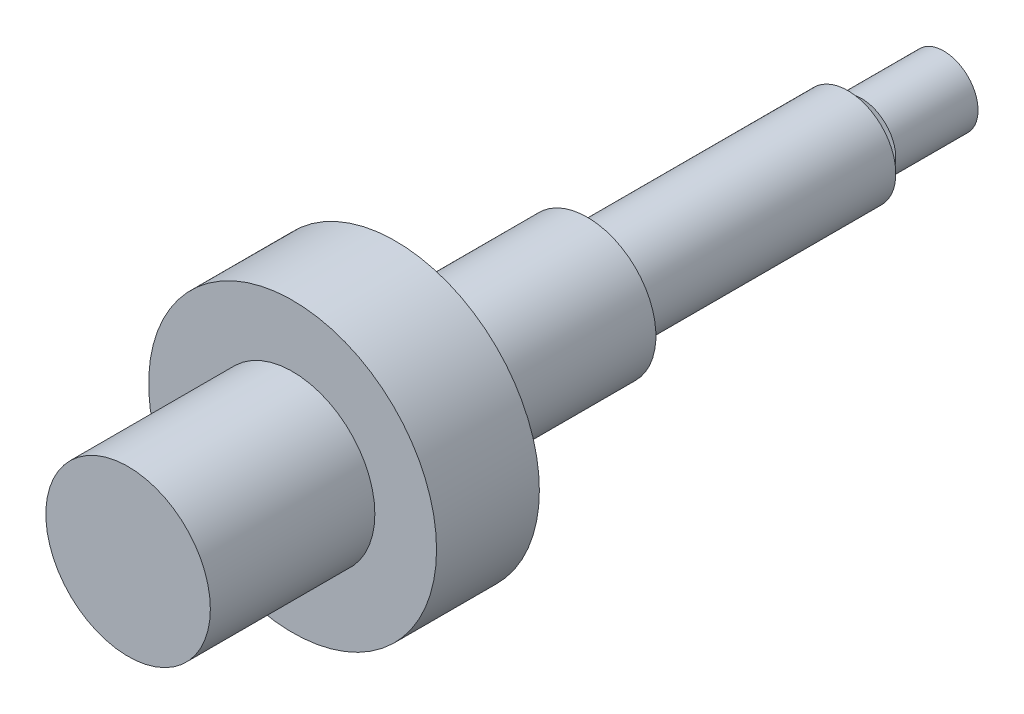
ISO-10303-21;
HEADER;
FILE_DESCRIPTION(('STEP AP214'),'2;1');
FILE_NAME('part.step','',(''),(''),'','','');
FILE_SCHEMA(('AUTOMOTIVE_DESIGN { 1 0 10303 214 1 1 1 1 }'));
ENDSEC;
DATA;
#1=APPLICATION_CONTEXT('core data for automotive mechanical design processes');
#2=APPLICATION_PROTOCOL_DEFINITION('international standard','automotive_design',2000,#1);
#3=PRODUCT_CONTEXT('',#1,'mechanical');
#4=PRODUCT('Part','Part','',(#3));
#5=PRODUCT_RELATED_PRODUCT_CATEGORY('part','',(#4));
#6=PRODUCT_DEFINITION_FORMATION('','',#4);
#7=PRODUCT_DEFINITION_CONTEXT('part definition',#1,'design');
#8=PRODUCT_DEFINITION('design','',#6,#7);
#9=PRODUCT_DEFINITION_SHAPE('','',#8);
#10=(LENGTH_UNIT() NAMED_UNIT(*) SI_UNIT(.MILLI.,.METRE.));
#11=(NAMED_UNIT(*) PLANE_ANGLE_UNIT() SI_UNIT($,.RADIAN.));
#12=(NAMED_UNIT(*) SI_UNIT($,.STERADIAN.) SOLID_ANGLE_UNIT());
#13=UNCERTAINTY_MEASURE_WITH_UNIT(LENGTH_MEASURE(1.E-05),#10,'distance_accuracy_value','');
#14=(GEOMETRIC_REPRESENTATION_CONTEXT(3) GLOBAL_UNCERTAINTY_ASSIGNED_CONTEXT((#13)) GLOBAL_UNIT_ASSIGNED_CONTEXT((#10,
#11,#12)) REPRESENTATION_CONTEXT('',''));
#15=CARTESIAN_POINT('',(0.,0.,0.));
#16=DIRECTION('',(0.,0.,1.));
#17=DIRECTION('',(1.,0.,0.));
#18=AXIS2_PLACEMENT_3D('',#15,#16,#17);
#19=CARTESIAN_POINT('',(0.,0.,-33.));
#20=DIRECTION('',(0.,0.,-1.));
#21=DIRECTION('',(-1.,0.,0.));
#22=AXIS2_PLACEMENT_3D('',#19,#20,#21);
#23=PLANE('',#22);
#24=CARTESIAN_POINT('',(0.,0.,-33.));
#25=DIRECTION('',(0.,0.,-1.));
#26=DIRECTION('',(-1.,0.,0.));
#27=AXIS2_PLACEMENT_3D('',#24,#25,#26);
#28=CIRCLE('',#27,3.5);
#29=CARTESIAN_POINT('',(-3.5,0.,-33.));
#30=VERTEX_POINT('',#29);
#31=EDGE_CURVE('E65',#30,#30,#28,.T.);
#32=ORIENTED_EDGE('',*,*,#31,.T.);
#33=EDGE_LOOP('',(#32));
#34=FACE_BOUND('',#33,.T.);
#35=CARTESIAN_POINT('',(0.,0.,-33.));
#36=DIRECTION('',(0.,0.,-1.));
#37=DIRECTION('',(-1.,0.,0.));
#38=AXIS2_PLACEMENT_3D('',#35,#36,#37);
#39=CIRCLE('',#38,1.5);
#40=CARTESIAN_POINT('',(-1.5,0.,-33.));
#41=VERTEX_POINT('',#40);
#42=EDGE_CURVE('E74',#41,#41,#39,.T.);
#43=ORIENTED_EDGE('',*,*,#42,.F.);
#44=EDGE_LOOP('',(#43));
#45=FACE_BOUND('',#44,.T.);
#46=ADVANCED_FACE('F29',(#34,#45),#23,.T.);
#47=CARTESIAN_POINT('',(0.,0.,-14.));
#48=DIRECTION('',(0.,0.,-1.));
#49=DIRECTION('',(-1.,0.,0.));
#50=AXIS2_PLACEMENT_3D('',#47,#48,#49);
#51=PLANE('',#50);
#52=CARTESIAN_POINT('',(0.,0.,-14.));
#53=DIRECTION('',(0.,0.,-1.));
#54=DIRECTION('',(-1.,0.,0.));
#55=AXIS2_PLACEMENT_3D('',#52,#53,#54);
#56=CIRCLE('',#55,5.);
#57=CARTESIAN_POINT('',(-5.,0.,-14.));
#58=VERTEX_POINT('',#57);
#59=EDGE_CURVE('E55',#58,#58,#56,.T.);
#60=ORIENTED_EDGE('',*,*,#59,.T.);
#61=EDGE_LOOP('',(#60));
#62=FACE_BOUND('',#61,.T.);
#63=CARTESIAN_POINT('',(0.,0.,-14.));
#64=DIRECTION('',(0.,0.,-1.));
#65=DIRECTION('',(-1.,0.,0.));
#66=AXIS2_PLACEMENT_3D('',#63,#64,#65);
#67=CIRCLE('',#66,2.5);
#68=CARTESIAN_POINT('',(-2.5,0.,-14.));
#69=VERTEX_POINT('',#68);
#70=EDGE_CURVE('E62',#69,#69,#67,.T.);
#71=ORIENTED_EDGE('',*,*,#70,.F.);
#72=EDGE_LOOP('',(#71));
#73=FACE_BOUND('',#72,.T.);
#74=ADVANCED_FACE('F108',(#62,#73),#51,.T.);
#75=CARTESIAN_POINT('',(0.,0.,0.));
#76=DIRECTION('',(0.,0.,1.));
#77=DIRECTION('',(1.,0.,0.));
#78=AXIS2_PLACEMENT_3D('',#75,#76,#77);
#79=PLANE('',#78);
#80=CARTESIAN_POINT('',(0.,0.,0.));
#81=DIRECTION('',(0.,0.,1.));
#82=DIRECTION('',(1.,0.,0.));
#83=AXIS2_PLACEMENT_3D('',#80,#81,#82);
#84=CIRCLE('',#83,10.5);
#85=CARTESIAN_POINT('',(10.5,0.,0.));
#86=VERTEX_POINT('',#85);
#87=EDGE_CURVE('E40',#86,#86,#84,.T.);
#88=ORIENTED_EDGE('',*,*,#87,.F.);
#89=EDGE_LOOP('',(#88));
#90=FACE_BOUND('',#89,.T.);
#91=CARTESIAN_POINT('',(0.,0.,0.));
#92=DIRECTION('',(0.,0.,1.));
#93=DIRECTION('',(1.,0.,0.));
#94=AXIS2_PLACEMENT_3D('',#91,#92,#93);
#95=CIRCLE('',#94,4.5);
#96=CARTESIAN_POINT('',(4.5,0.,0.));
#97=VERTEX_POINT('',#96);
#98=EDGE_CURVE('E10',#97,#97,#95,.F.);
#99=ORIENTED_EDGE('',*,*,#98,.F.);
#100=EDGE_LOOP('',(#99));
#101=FACE_BOUND('',#100,.T.);
#102=ADVANCED_FACE('F114',(#90,#101),#79,.F.);
#103=CARTESIAN_POINT('',(-7.,33.,7.5));
#104=DIRECTION('',(0.,0.,1.));
#105=DIRECTION('',(1.,0.,0.));
#106=AXIS2_PLACEMENT_3D('',#103,#104,#105);
#107=PLANE('',#106);
#108=CARTESIAN_POINT('',(0.,0.,7.5));
#109=DIRECTION('',(0.,0.,1.));
#110=DIRECTION('',(1.,0.,0.));
#111=AXIS2_PLACEMENT_3D('',#108,#109,#110);
#112=CIRCLE('',#111,10.5);
#113=CARTESIAN_POINT('',(10.5,0.,7.5));
#114=VERTEX_POINT('',#113);
#115=EDGE_CURVE('E36',#114,#114,#112,.T.);
#116=ORIENTED_EDGE('',*,*,#115,.T.);
#117=EDGE_LOOP('',(#116));
#118=FACE_BOUND('',#117,.T.);
#119=CARTESIAN_POINT('',(0.,0.,7.5));
#120=DIRECTION('',(0.,0.,1.));
#121=DIRECTION('',(1.,0.,0.));
#122=AXIS2_PLACEMENT_3D('',#119,#120,#121);
#123=CIRCLE('',#122,6.);
#124=CARTESIAN_POINT('',(6.,0.,7.5));
#125=VERTEX_POINT('',#124);
#126=EDGE_CURVE('E47',#125,#125,#123,.T.);
#127=ORIENTED_EDGE('',*,*,#126,.F.);
#128=EDGE_LOOP('',(#127));
#129=FACE_BOUND('',#128,.T.);
#130=ADVANCED_FACE('F31',(#118,#129),#107,.T.);
#131=CARTESIAN_POINT('',(0.,0.,37.198484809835));
#132=DIRECTION('',(0.,0.,-1.));
#133=DIRECTION('',(-1.,0.,0.));
#134=AXIS2_PLACEMENT_3D('',#131,#132,#133);
#135=CYLINDRICAL_SURFACE('',#134,10.5);
#136=ORIENTED_EDGE('',*,*,#87,.T.);
#137=EDGE_LOOP('',(#136));
#138=FACE_BOUND('',#137,.T.);
#139=ORIENTED_EDGE('',*,*,#115,.F.);
#140=EDGE_LOOP('',(#139));
#141=FACE_BOUND('',#140,.T.);
#142=ADVANCED_FACE('F148',(#138,#141),#135,.T.);
#143=CARTESIAN_POINT('',(0.,0.,19.5));
#144=DIRECTION('',(0.,0.,-1.));
#145=DIRECTION('',(-1.,0.,0.));
#146=AXIS2_PLACEMENT_3D('',#143,#144,#145);
#147=CYLINDRICAL_SURFACE('',#146,6.);
#148=CARTESIAN_POINT('',(0.,0.,19.5));
#149=DIRECTION('',(0.,0.,1.));
#150=DIRECTION('',(1.,0.,0.));
#151=AXIS2_PLACEMENT_3D('',#148,#149,#150);
#152=CIRCLE('',#151,6.);
#153=CARTESIAN_POINT('',(6.,0.,19.5));
#154=VERTEX_POINT('',#153);
#155=EDGE_CURVE('E44',#154,#154,#152,.T.);
#156=ORIENTED_EDGE('',*,*,#155,.F.);
#157=EDGE_LOOP('',(#156));
#158=FACE_BOUND('',#157,.T.);
#159=ORIENTED_EDGE('',*,*,#126,.T.);
#160=EDGE_LOOP('',(#159));
#161=FACE_BOUND('',#160,.T.);
#162=ADVANCED_FACE('F144',(#158,#161),#147,.T.);
#163=CARTESIAN_POINT('',(0.,0.,19.5));
#164=DIRECTION('',(0.,0.,1.));
#165=DIRECTION('',(1.,0.,0.));
#166=AXIS2_PLACEMENT_3D('',#163,#164,#165);
#167=PLANE('',#166);
#168=ORIENTED_EDGE('',*,*,#155,.T.);
#169=EDGE_LOOP('',(#168));
#170=FACE_BOUND('',#169,.T.);
#171=ADVANCED_FACE('F140',(#170),#167,.T.);
#172=CARTESIAN_POINT('',(0.,0.,-1.));
#173=DIRECTION('',(0.,0.,1.));
#174=DIRECTION('',(1.,0.,0.));
#175=AXIS2_PLACEMENT_3D('',#172,#173,#174);
#176=CYLINDRICAL_SURFACE('',#175,4.5);
#177=CARTESIAN_POINT('',(0.,0.,-1.));
#178=DIRECTION('',(0.,0.,-1.));
#179=DIRECTION('',(-1.,0.,0.));
#180=AXIS2_PLACEMENT_3D('',#177,#178,#179);
#181=CIRCLE('',#180,4.5);
#182=CARTESIAN_POINT('',(-4.5,0.,-1.));
#183=VERTEX_POINT('',#182);
#184=EDGE_CURVE('E50',#183,#183,#181,.T.);
#185=ORIENTED_EDGE('',*,*,#184,.F.);
#186=EDGE_LOOP('',(#185));
#187=FACE_BOUND('',#186,.T.);
#188=ORIENTED_EDGE('',*,*,#98,.T.);
#189=EDGE_LOOP('',(#188));
#190=FACE_BOUND('',#189,.T.);
#191=ADVANCED_FACE('F133',(#187,#190),#176,.T.);
#192=CARTESIAN_POINT('',(0.,0.,-1.));
#193=DIRECTION('',(0.,0.,-1.));
#194=DIRECTION('',(-1.,0.,0.));
#195=AXIS2_PLACEMENT_3D('',#192,#193,#194);
#196=PLANE('',#195);
#197=CARTESIAN_POINT('',(0.,0.,-1.));
#198=DIRECTION('',(0.,0.,-1.));
#199=DIRECTION('',(-1.,0.,0.));
#200=AXIS2_PLACEMENT_3D('',#197,#198,#199);
#201=CIRCLE('',#200,5.);
#202=CARTESIAN_POINT('',(-5.,0.,-1.));
#203=VERTEX_POINT('',#202);
#204=EDGE_CURVE('E58',#203,#203,#201,.T.);
#205=ORIENTED_EDGE('',*,*,#204,.F.);
#206=EDGE_LOOP('',(#205));
#207=FACE_BOUND('',#206,.T.);
#208=ORIENTED_EDGE('',*,*,#184,.T.);
#209=EDGE_LOOP('',(#208));
#210=FACE_BOUND('',#209,.T.);
#211=ADVANCED_FACE('F130',(#207,#210),#196,.F.);
#212=CARTESIAN_POINT('',(0.,0.,-28.142135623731));
#213=DIRECTION('',(0.,0.,1.));
#214=DIRECTION('',(1.,0.,0.));
#215=AXIS2_PLACEMENT_3D('',#212,#213,#214);
#216=CYLINDRICAL_SURFACE('',#215,5.);
#217=ORIENTED_EDGE('',*,*,#204,.T.);
#218=EDGE_LOOP('',(#217));
#219=FACE_BOUND('',#218,.T.);
#220=ORIENTED_EDGE('',*,*,#59,.F.);
#221=EDGE_LOOP('',(#220));
#222=FACE_BOUND('',#221,.T.);
#223=ADVANCED_FACE('F128',(#219,#222),#216,.T.);
#224=CARTESIAN_POINT('',(0.,0.,-15.));
#225=DIRECTION('',(0.,0.,1.));
#226=DIRECTION('',(1.,0.,0.));
#227=AXIS2_PLACEMENT_3D('',#224,#225,#226);
#228=CYLINDRICAL_SURFACE('',#227,2.5);
#229=CARTESIAN_POINT('',(0.,0.,-15.));
#230=DIRECTION('',(0.,0.,-1.));
#231=DIRECTION('',(-1.,0.,0.));
#232=AXIS2_PLACEMENT_3D('',#229,#230,#231);
#233=CIRCLE('',#232,2.5);
#234=CARTESIAN_POINT('',(-2.5,0.,-15.));
#235=VERTEX_POINT('',#234);
#236=EDGE_CURVE('E61',#235,#235,#233,.T.);
#237=ORIENTED_EDGE('',*,*,#236,.F.);
#238=EDGE_LOOP('',(#237));
#239=FACE_BOUND('',#238,.T.);
#240=ORIENTED_EDGE('',*,*,#70,.T.);
#241=EDGE_LOOP('',(#240));
#242=FACE_BOUND('',#241,.T.);
#243=ADVANCED_FACE('F121',(#239,#242),#228,.T.);
#244=CARTESIAN_POINT('',(0.,0.,-15.));
#245=DIRECTION('',(0.,0.,-1.));
#246=DIRECTION('',(-1.,0.,0.));
#247=AXIS2_PLACEMENT_3D('',#244,#245,#246);
#248=PLANE('',#247);
#249=CARTESIAN_POINT('',(0.,0.,-15.));
#250=DIRECTION('',(0.,0.,-1.));
#251=DIRECTION('',(-1.,0.,0.));
#252=AXIS2_PLACEMENT_3D('',#249,#250,#251);
#253=CIRCLE('',#252,3.5);
#254=CARTESIAN_POINT('',(-3.5,0.,-15.));
#255=VERTEX_POINT('',#254);
#256=EDGE_CURVE('E68',#255,#255,#253,.T.);
#257=ORIENTED_EDGE('',*,*,#256,.F.);
#258=EDGE_LOOP('',(#257));
#259=FACE_BOUND('',#258,.T.);
#260=ORIENTED_EDGE('',*,*,#236,.T.);
#261=EDGE_LOOP('',(#260));
#262=FACE_BOUND('',#261,.T.);
#263=ADVANCED_FACE('F118',(#259,#262),#248,.F.);
#264=CARTESIAN_POINT('',(0.,0.,-33.));
#265=DIRECTION('',(0.,0.,1.));
#266=DIRECTION('',(1.,0.,0.));
#267=AXIS2_PLACEMENT_3D('',#264,#265,#266);
#268=CYLINDRICAL_SURFACE('',#267,3.5);
#269=ORIENTED_EDGE('',*,*,#31,.F.);
#270=EDGE_LOOP('',(#269));
#271=FACE_BOUND('',#270,.T.);
#272=ORIENTED_EDGE('',*,*,#256,.T.);
#273=EDGE_LOOP('',(#272));
#274=FACE_BOUND('',#273,.T.);
#275=ADVANCED_FACE('F103',(#271,#274),#268,.T.);
#276=CARTESIAN_POINT('',(0.,0.,-34.));
#277=DIRECTION('',(0.,0.,1.));
#278=DIRECTION('',(1.,0.,0.));
#279=AXIS2_PLACEMENT_3D('',#276,#277,#278);
#280=CYLINDRICAL_SURFACE('',#279,1.5);
#281=CARTESIAN_POINT('',(0.,0.,-34.));
#282=DIRECTION('',(0.,0.,-1.));
#283=DIRECTION('',(-1.,0.,0.));
#284=AXIS2_PLACEMENT_3D('',#281,#282,#283);
#285=CIRCLE('',#284,1.5);
#286=CARTESIAN_POINT('',(-1.5,0.,-34.));
#287=VERTEX_POINT('',#286);
#288=EDGE_CURVE('E71',#287,#287,#285,.T.);
#289=ORIENTED_EDGE('',*,*,#288,.F.);
#290=EDGE_LOOP('',(#289));
#291=FACE_BOUND('',#290,.T.);
#292=ORIENTED_EDGE('',*,*,#42,.T.);
#293=EDGE_LOOP('',(#292));
#294=FACE_BOUND('',#293,.T.);
#295=ADVANCED_FACE('F97',(#291,#294),#280,.T.);
#296=CARTESIAN_POINT('',(0.,0.,-34.));
#297=DIRECTION('',(0.,0.,-1.));
#298=DIRECTION('',(-1.,0.,0.));
#299=AXIS2_PLACEMENT_3D('',#296,#297,#298);
#300=PLANE('',#299);
#301=CARTESIAN_POINT('',(0.,0.,-34.));
#302=DIRECTION('',(0.,0.,-1.));
#303=DIRECTION('',(-1.,0.,0.));
#304=AXIS2_PLACEMENT_3D('',#301,#302,#303);
#305=CIRCLE('',#304,2.5);
#306=CARTESIAN_POINT('',(-2.5,0.,-34.));
#307=VERTEX_POINT('',#306);
#308=EDGE_CURVE('E80',#307,#307,#305,.T.);
#309=ORIENTED_EDGE('',*,*,#308,.F.);
#310=EDGE_LOOP('',(#309));
#311=FACE_BOUND('',#310,.T.);
#312=ORIENTED_EDGE('',*,*,#288,.T.);
#313=EDGE_LOOP('',(#312));
#314=FACE_BOUND('',#313,.T.);
#315=ADVANCED_FACE('F91',(#311,#314),#300,.F.);
#316=CARTESIAN_POINT('',(0.,0.,-40.));
#317=DIRECTION('',(0.,0.,1.));
#318=DIRECTION('',(1.,0.,0.));
#319=AXIS2_PLACEMENT_3D('',#316,#317,#318);
#320=CYLINDRICAL_SURFACE('',#319,2.5);
#321=CARTESIAN_POINT('',(0.,0.,-40.));
#322=DIRECTION('',(0.,0.,-1.));
#323=DIRECTION('',(-1.,0.,0.));
#324=AXIS2_PLACEMENT_3D('',#321,#322,#323);
#325=CIRCLE('',#324,2.5);
#326=CARTESIAN_POINT('',(-2.5,0.,-40.));
#327=VERTEX_POINT('',#326);
#328=EDGE_CURVE('E77',#327,#327,#325,.T.);
#329=ORIENTED_EDGE('',*,*,#328,.F.);
#330=EDGE_LOOP('',(#329));
#331=FACE_BOUND('',#330,.T.);
#332=ORIENTED_EDGE('',*,*,#308,.T.);
#333=EDGE_LOOP('',(#332));
#334=FACE_BOUND('',#333,.T.);
#335=ADVANCED_FACE('F88',(#331,#334),#320,.T.);
#336=CARTESIAN_POINT('',(0.,0.,-40.));
#337=DIRECTION('',(0.,0.,-1.));
#338=DIRECTION('',(-1.,0.,0.));
#339=AXIS2_PLACEMENT_3D('',#336,#337,#338);
#340=PLANE('',#339);
#341=ORIENTED_EDGE('',*,*,#328,.T.);
#342=EDGE_LOOP('',(#341));
#343=FACE_BOUND('',#342,.T.);
#344=ADVANCED_FACE('F86',(#343),#340,.T.);
#345=CLOSED_SHELL('',(#46,#74,#102,#130,#142,#162,#171,#191,#211,#223,#243,#263,#275,#295,#315,
#335,#344));
#346=MANIFOLD_SOLID_BREP('B2',#345);
#347=ADVANCED_BREP_SHAPE_REPRESENTATION('',(#18,#346),#14);
#348=SHAPE_DEFINITION_REPRESENTATION(#9,#347);
ENDSEC;
END-ISO-10303-21;
